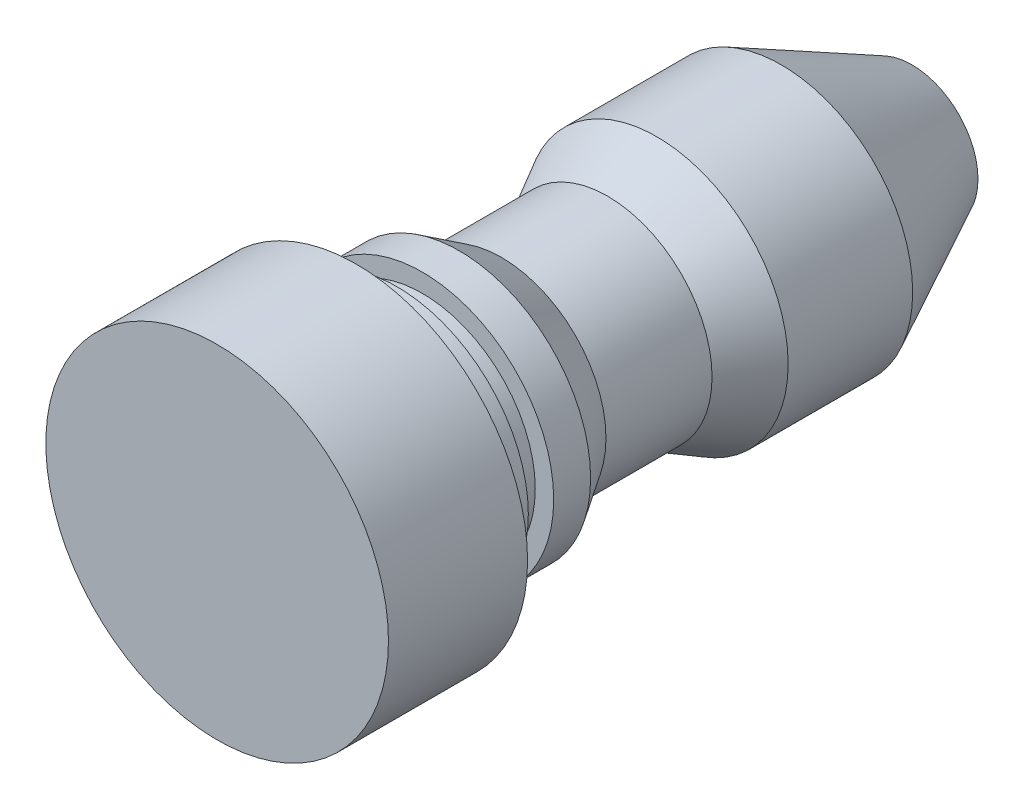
from build123d import *


with BuildPart() as part:
    # Sketch1 → Revolve1 (revolve)
    with BuildSketch(Plane(origin=(0, 0, 0), x_dir=(0, 0, -1), z_dir=(1, 0, 0)), mode=Mode.PRIVATE) as revolve1_sk:
        Polygon((-26.080533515, 0), (-26.080533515, 10.018632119), (-17.944117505, 10.018632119), (-17.944117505, 7.681098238), (-15.561631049, 7.681098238), (-15.561631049, 6.602236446), (-14.078196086, 6.602236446), (-14.078196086, 7.681098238), (-11.920472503, 7.681098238), (-9.448080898, 6.107758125), (-3.244625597, 6.107758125), (-0.36766082, 7.681098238), (6.914656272, 7.681098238), (14.556593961, 3.860129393), (14.556593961, 0), align=None)
    revolve(revolve1_sk.sketch.rotate(Axis((0, 0, 36.223734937), (0, 0, -1)), 90), axis=Axis((0, 0, 36.223734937), (0, 0, -1)))


solid = part.part
